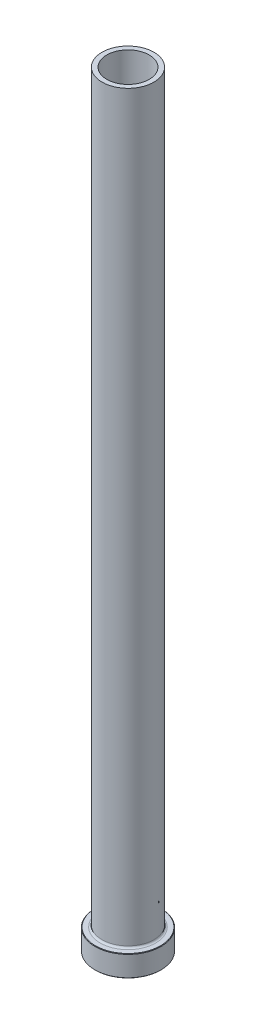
from build123d import *

# Parameters (mm, degrees)
FILLET1_R     = 0.8
CHAMFER1_SIZE = 0.2
CHAMFER3_SIZE = 0.5


with BuildPart() as part:
    # Sketch1 → Revolve1 (revolve)
    with BuildSketch(Plane.XY, mode=Mode.PRIVATE) as revolve1_sk:
        Polygon((-9, 325), (-11, 325), (-11, 9), (-14, 9), (-14, 0), (-9.25, 0), (-9.25, 258), (-9, 270), align=None)
    revolve(revolve1_sk.sketch.rotate(Axis((0, 92.187680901, 0), (0, -1, 0)), 270), axis=Axis((0, 92.187680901, 0), (0, -1, 0)))

    # Fillet1
    fillet1_edges = [part.edges().sort_by_distance(p)[0] for p in [
        (0, 9, -11),
    ]]
    fillet(fillet1_edges, radius=FILLET1_R)

    # Chamfer1
    chamfer1_edges = [part.edges().sort_by_distance(p)[0] for p in [
        (0, 0, -14),
        (0, 9, -14),
    ]]
    chamfer(chamfer1_edges, length=CHAMFER1_SIZE)

    # Chamfer3
    chamfer3_edges = [part.edges().sort_by_distance(p)[0] for p in [
        (0, 0, -9.25),
    ]]
    chamfer(chamfer3_edges, length=CHAMFER3_SIZE)


solid = part.part
